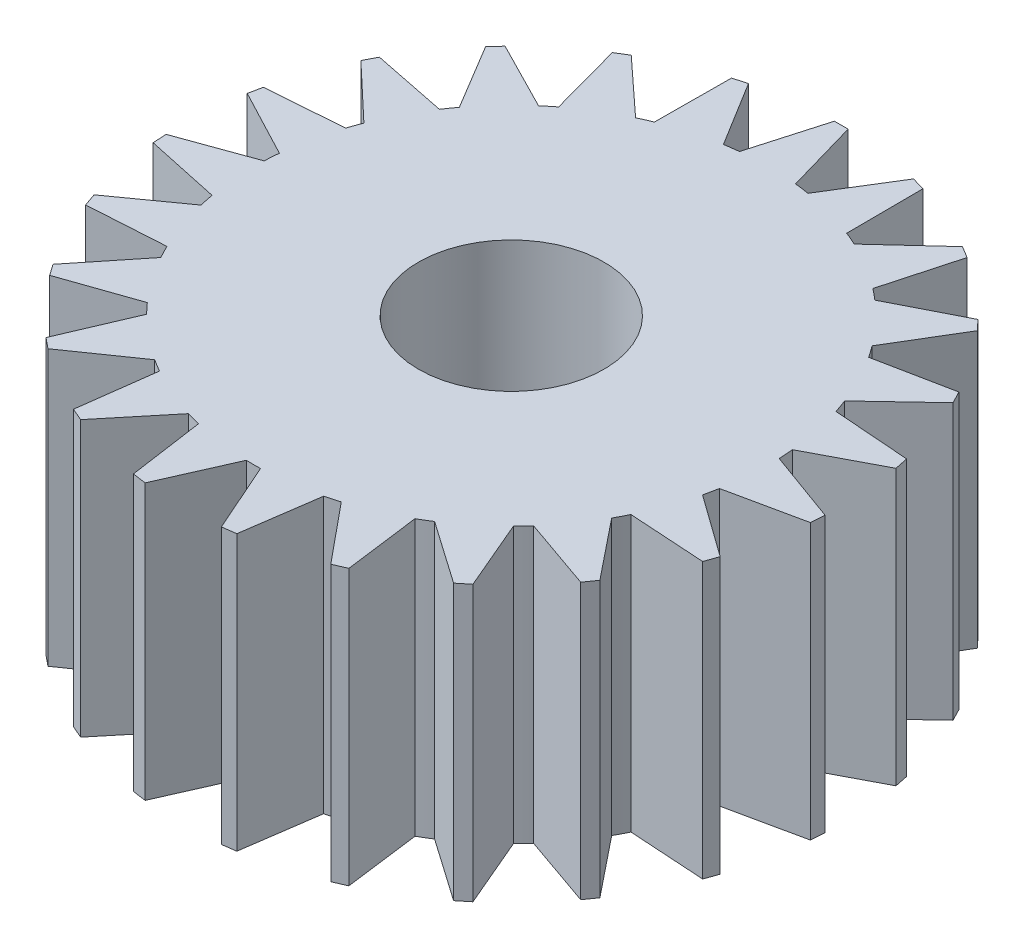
from build123d import *

# Parameters (mm, degrees)
SKETCH_1_R               = 7.5
SKETCH_1_R_2             = 2.7
EXTRUDE_1_DEPTH          = 8
EXTRUDE_2_DEPTH          = 8
PATTERN_CIRCULAR_1_COUNT = 23
PATTERN_CIRCULAR_1_ANGLE = 344.3


with BuildPart() as part:
    # Sketch 1 → Extrude 1 (new body)
    with BuildSketch(Plane(origin=(0, 0, 0), x_dir=(1, 0, 0), z_dir=(0, 1, 0))):
        with Locations(Location((-6.516055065, 1.577878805, 0), (0, 0, 270))):
            Circle(SKETCH_1_R)
        with Locations(Location((-6.516055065, 1.577878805, 0), (0, 0, 270))):
            Circle(SKETCH_1_R_2, mode=Mode.SUBTRACT)
    extrude(amount=EXTRUDE_1_DEPTH)

    # Sketch 1_3 → Extrude 2 (add)
    with BuildSketch(Plane(origin=(0, 0, 0), x_dir=(1, 0, 0), z_dir=(0, 1, 0))):
        with BuildLine():
            Line((-6.316055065, 11.177878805), (-6.516055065, 11.177878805))
            Line((-6.516055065, 11.177878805), (-6.716055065, 11.177878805))
            Line((-6.716055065, 11.177878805), (-7.330952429, 9.033476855))
            ThreePointArc((-7.330952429, 9.033476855), (-6.516055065, 9.077878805), (-5.7011577, 9.033476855))
            Line((-5.7011577, 9.033476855), (-6.316055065, 11.177878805))
        make_face()
    extrude_2 = extrude(amount=EXTRUDE_2_DEPTH)

    # Pattern Circular 1: Extrude 2 ×23 about axis
    pattern_circular_1_axis = Axis((-6.516055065, 0, -1.577878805), (0, 1, 0))
    for i in range(1, PATTERN_CIRCULAR_1_COUNT):
        add(extrude_2.rotate(pattern_circular_1_axis, i * PATTERN_CIRCULAR_1_ANGLE / (PATTERN_CIRCULAR_1_COUNT - 1)))


solid = part.part
